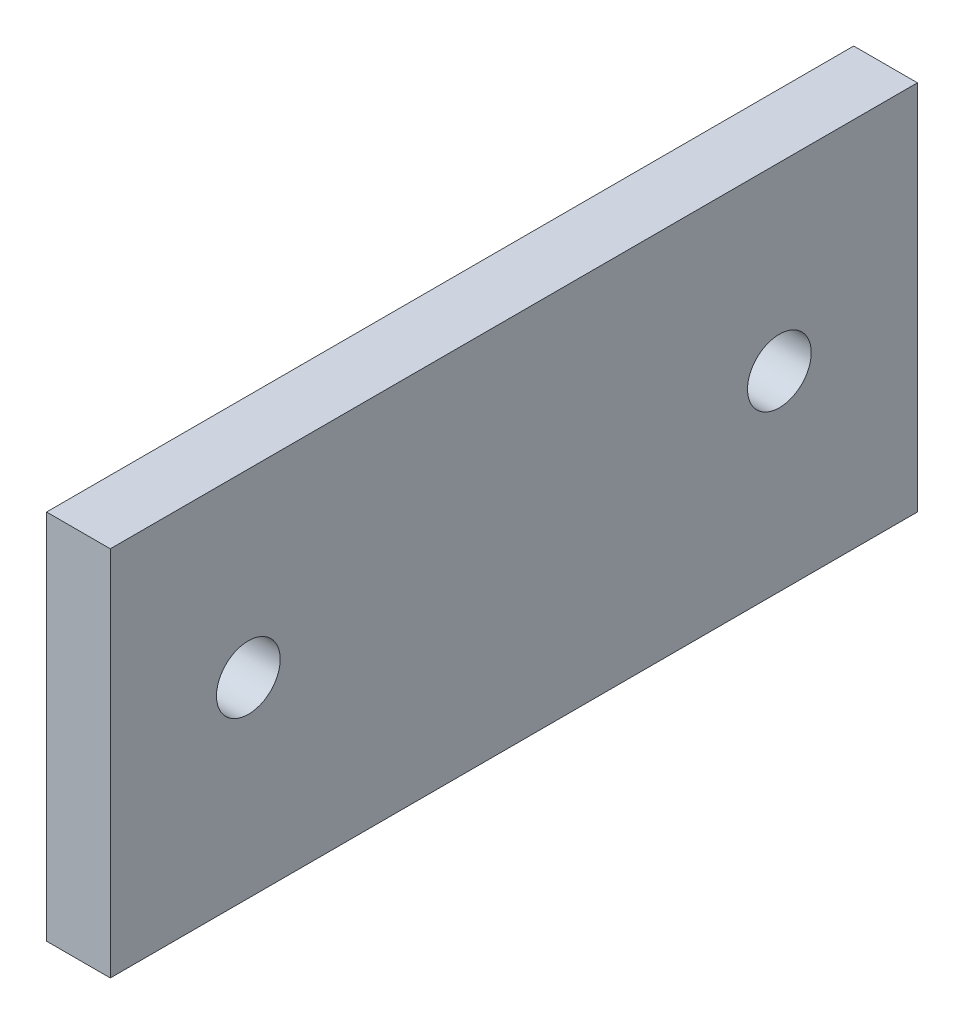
ISO-10303-21;
HEADER;
FILE_DESCRIPTION(('STEP AP214'),'2;1');
FILE_NAME('part.step','',(''),(''),'','','');
FILE_SCHEMA(('AUTOMOTIVE_DESIGN { 1 0 10303 214 1 1 1 1 }'));
ENDSEC;
DATA;
#1=APPLICATION_CONTEXT('core data for automotive mechanical design processes');
#2=APPLICATION_PROTOCOL_DEFINITION('international standard','automotive_design',2000,#1);
#3=PRODUCT_CONTEXT('',#1,'mechanical');
#4=PRODUCT('Part','Part','',(#3));
#5=PRODUCT_RELATED_PRODUCT_CATEGORY('part','',(#4));
#6=PRODUCT_DEFINITION_FORMATION('','',#4);
#7=PRODUCT_DEFINITION_CONTEXT('part definition',#1,'design');
#8=PRODUCT_DEFINITION('design','',#6,#7);
#9=PRODUCT_DEFINITION_SHAPE('','',#8);
#10=(LENGTH_UNIT() NAMED_UNIT(*) SI_UNIT(.MILLI.,.METRE.));
#11=(NAMED_UNIT(*) PLANE_ANGLE_UNIT() SI_UNIT($,.RADIAN.));
#12=(NAMED_UNIT(*) SI_UNIT($,.STERADIAN.) SOLID_ANGLE_UNIT());
#13=UNCERTAINTY_MEASURE_WITH_UNIT(LENGTH_MEASURE(1.E-05),#10,'distance_accuracy_value','');
#14=(GEOMETRIC_REPRESENTATION_CONTEXT(3) GLOBAL_UNCERTAINTY_ASSIGNED_CONTEXT((#13)) GLOBAL_UNIT_ASSIGNED_CONTEXT((#10,
#11,#12)) REPRESENTATION_CONTEXT('',''));
#15=CARTESIAN_POINT('',(0.,0.,0.));
#16=DIRECTION('',(0.,0.,1.));
#17=DIRECTION('',(1.,0.,0.));
#18=AXIS2_PLACEMENT_3D('',#15,#16,#17);
#19=CARTESIAN_POINT('',(3.,0.,0.));
#20=DIRECTION('',(-1.,0.,0.));
#21=DIRECTION('',(0.,0.,1.));
#22=AXIS2_PLACEMENT_3D('',#19,#20,#21);
#23=PLANE('',#22);
#24=DIRECTION('',(0.,1.,0.));
#25=VECTOR('',#24,1.);
#26=CARTESIAN_POINT('',(3.,-17.5,-38.));
#27=LINE('',#26,#25);
#28=CARTESIAN_POINT('',(3.,-17.5,-38.));
#29=VERTEX_POINT('',#28);
#30=CARTESIAN_POINT('',(3.,17.5,-38.));
#31=VERTEX_POINT('',#30);
#32=EDGE_CURVE('E94',#29,#31,#27,.T.);
#33=ORIENTED_EDGE('',*,*,#32,.T.);
#34=DIRECTION('',(0.,0.,1.));
#35=VECTOR('',#34,1.);
#36=CARTESIAN_POINT('',(3.,17.5,38.));
#37=LINE('',#36,#35);
#38=CARTESIAN_POINT('',(3.,17.5,38.));
#39=VERTEX_POINT('',#38);
#40=EDGE_CURVE('E89',#31,#39,#37,.T.);
#41=ORIENTED_EDGE('',*,*,#40,.T.);
#42=DIRECTION('',(0.,-1.,0.));
#43=VECTOR('',#42,1.);
#44=CARTESIAN_POINT('',(3.,-17.5,38.));
#45=LINE('',#44,#43);
#46=CARTESIAN_POINT('',(3.,-17.5,38.));
#47=VERTEX_POINT('',#46);
#48=EDGE_CURVE('E92',#39,#47,#45,.T.);
#49=ORIENTED_EDGE('',*,*,#48,.T.);
#50=DIRECTION('',(0.,0.,-1.));
#51=VECTOR('',#50,1.);
#52=CARTESIAN_POINT('',(3.,-17.5,38.));
#53=LINE('',#52,#51);
#54=EDGE_CURVE('E59',#47,#29,#53,.T.);
#55=ORIENTED_EDGE('',*,*,#54,.T.);
#56=EDGE_LOOP('',(#33,#41,#49,#55));
#57=FACE_BOUND('',#56,.T.);
#58=CARTESIAN_POINT('',(3.,0.5,-25.));
#59=DIRECTION('',(1.,0.,0.));
#60=DIRECTION('',(0.,0.,-1.));
#61=AXIS2_PLACEMENT_3D('',#58,#59,#60);
#62=CIRCLE('',#61,3.);
#63=CARTESIAN_POINT('',(3.,0.5,-28.));
#64=VERTEX_POINT('',#63);
#65=EDGE_CURVE('E115',#64,#64,#62,.T.);
#66=ORIENTED_EDGE('',*,*,#65,.F.);
#67=EDGE_LOOP('',(#66));
#68=FACE_BOUND('',#67,.T.);
#69=CARTESIAN_POINT('',(3.,0.5,25.));
#70=DIRECTION('',(1.,0.,0.));
#71=DIRECTION('',(0.,0.,1.));
#72=AXIS2_PLACEMENT_3D('',#69,#70,#71);
#73=CIRCLE('',#72,3.);
#74=CARTESIAN_POINT('',(3.,0.5,28.));
#75=VERTEX_POINT('',#74);
#76=EDGE_CURVE('E139',#75,#75,#73,.T.);
#77=ORIENTED_EDGE('',*,*,#76,.F.);
#78=EDGE_LOOP('',(#77));
#79=FACE_BOUND('',#78,.T.);
#80=ADVANCED_FACE('F41',(#57,#68,#79),#23,.F.);
#81=CARTESIAN_POINT('',(-3.,0.,0.));
#82=DIRECTION('',(-1.,0.,0.));
#83=DIRECTION('',(0.,0.,1.));
#84=AXIS2_PLACEMENT_3D('',#81,#82,#83);
#85=PLANE('',#84);
#86=CARTESIAN_POINT('',(-3.,0.5,-25.));
#87=DIRECTION('',(1.,0.,0.));
#88=DIRECTION('',(0.,0.,-1.));
#89=AXIS2_PLACEMENT_3D('',#86,#87,#88);
#90=CIRCLE('',#89,3.);
#91=CARTESIAN_POINT('',(-3.,0.5,-28.));
#92=VERTEX_POINT('',#91);
#93=EDGE_CURVE('E135',#92,#92,#90,.T.);
#94=ORIENTED_EDGE('',*,*,#93,.T.);
#95=EDGE_LOOP('',(#94));
#96=FACE_BOUND('',#95,.T.);
#97=DIRECTION('',(0.,1.,0.));
#98=VECTOR('',#97,1.);
#99=CARTESIAN_POINT('',(-3.,-17.5,-38.));
#100=LINE('',#99,#98);
#101=CARTESIAN_POINT('',(-3.,-17.5,-38.));
#102=VERTEX_POINT('',#101);
#103=CARTESIAN_POINT('',(-3.,17.5,-38.));
#104=VERTEX_POINT('',#103);
#105=EDGE_CURVE('E111',#102,#104,#100,.T.);
#106=ORIENTED_EDGE('',*,*,#105,.F.);
#107=DIRECTION('',(0.,0.,-1.));
#108=VECTOR('',#107,1.);
#109=CARTESIAN_POINT('',(-3.,-17.5,38.));
#110=LINE('',#109,#108);
#111=CARTESIAN_POINT('',(-3.,-17.5,38.));
#112=VERTEX_POINT('',#111);
#113=EDGE_CURVE('E82',#112,#102,#110,.T.);
#114=ORIENTED_EDGE('',*,*,#113,.F.);
#115=DIRECTION('',(0.,-1.,0.));
#116=VECTOR('',#115,1.);
#117=CARTESIAN_POINT('',(-3.,-17.5,38.));
#118=LINE('',#117,#116);
#119=CARTESIAN_POINT('',(-3.,17.5,38.));
#120=VERTEX_POINT('',#119);
#121=EDGE_CURVE('E76',#120,#112,#118,.T.);
#122=ORIENTED_EDGE('',*,*,#121,.F.);
#123=DIRECTION('',(0.,0.,1.));
#124=VECTOR('',#123,1.);
#125=CARTESIAN_POINT('',(-3.,17.5,38.));
#126=LINE('',#125,#124);
#127=EDGE_CURVE('E99',#104,#120,#126,.T.);
#128=ORIENTED_EDGE('',*,*,#127,.F.);
#129=EDGE_LOOP('',(#106,#114,#122,#128));
#130=FACE_BOUND('',#129,.T.);
#131=CARTESIAN_POINT('',(-3.,0.5,25.));
#132=DIRECTION('',(1.,0.,0.));
#133=DIRECTION('',(0.,0.,1.));
#134=AXIS2_PLACEMENT_3D('',#131,#132,#133);
#135=CIRCLE('',#134,3.);
#136=CARTESIAN_POINT('',(-3.,0.5,28.));
#137=VERTEX_POINT('',#136);
#138=EDGE_CURVE('E143',#137,#137,#135,.T.);
#139=ORIENTED_EDGE('',*,*,#138,.T.);
#140=EDGE_LOOP('',(#139));
#141=FACE_BOUND('',#140,.T.);
#142=ADVANCED_FACE('F129',(#96,#130,#141),#85,.T.);
#143=CARTESIAN_POINT('',(3.,-17.5,-38.));
#144=DIRECTION('',(0.,0.,1.));
#145=DIRECTION('',(1.,0.,0.));
#146=AXIS2_PLACEMENT_3D('',#143,#144,#145);
#147=PLANE('',#146);
#148=ORIENTED_EDGE('',*,*,#105,.T.);
#149=DIRECTION('',(-1.,0.,0.));
#150=VECTOR('',#149,1.);
#151=CARTESIAN_POINT('',(3.,17.5,-38.));
#152=LINE('',#151,#150);
#153=EDGE_CURVE('E11',#31,#104,#152,.T.);
#154=ORIENTED_EDGE('',*,*,#153,.F.);
#155=ORIENTED_EDGE('',*,*,#32,.F.);
#156=DIRECTION('',(-1.,0.,0.));
#157=VECTOR('',#156,1.);
#158=CARTESIAN_POINT('',(3.,-17.5,-38.));
#159=LINE('',#158,#157);
#160=EDGE_CURVE('E107',#29,#102,#159,.T.);
#161=ORIENTED_EDGE('',*,*,#160,.T.);
#162=EDGE_LOOP('',(#148,#154,#155,#161));
#163=FACE_BOUND('',#162,.T.);
#164=ADVANCED_FACE('F43',(#163),#147,.F.);
#165=CARTESIAN_POINT('',(3.,17.5,38.));
#166=DIRECTION('',(0.,-1.,0.));
#167=DIRECTION('',(0.,0.,-1.));
#168=AXIS2_PLACEMENT_3D('',#165,#166,#167);
#169=PLANE('',#168);
#170=ORIENTED_EDGE('',*,*,#127,.T.);
#171=DIRECTION('',(-1.,0.,0.));
#172=VECTOR('',#171,1.);
#173=CARTESIAN_POINT('',(3.,17.5,38.));
#174=LINE('',#173,#172);
#175=EDGE_CURVE('E51',#39,#120,#174,.T.);
#176=ORIENTED_EDGE('',*,*,#175,.F.);
#177=ORIENTED_EDGE('',*,*,#40,.F.);
#178=ORIENTED_EDGE('',*,*,#153,.T.);
#179=EDGE_LOOP('',(#170,#176,#177,#178));
#180=FACE_BOUND('',#179,.T.);
#181=ADVANCED_FACE('F98',(#180),#169,.F.);
#182=CARTESIAN_POINT('',(3.,-17.5,38.));
#183=DIRECTION('',(0.,0.,-1.));
#184=DIRECTION('',(-1.,0.,0.));
#185=AXIS2_PLACEMENT_3D('',#182,#183,#184);
#186=PLANE('',#185);
#187=ORIENTED_EDGE('',*,*,#121,.T.);
#188=DIRECTION('',(-1.,0.,0.));
#189=VECTOR('',#188,1.);
#190=CARTESIAN_POINT('',(3.,-17.5,38.));
#191=LINE('',#190,#189);
#192=EDGE_CURVE('E101',#47,#112,#191,.T.);
#193=ORIENTED_EDGE('',*,*,#192,.F.);
#194=ORIENTED_EDGE('',*,*,#48,.F.);
#195=ORIENTED_EDGE('',*,*,#175,.T.);
#196=EDGE_LOOP('',(#187,#193,#194,#195));
#197=FACE_BOUND('',#196,.T.);
#198=ADVANCED_FACE('F102',(#197),#186,.F.);
#199=CARTESIAN_POINT('',(3.,-17.5,38.));
#200=DIRECTION('',(0.,1.,0.));
#201=DIRECTION('',(0.,0.,1.));
#202=AXIS2_PLACEMENT_3D('',#199,#200,#201);
#203=PLANE('',#202);
#204=ORIENTED_EDGE('',*,*,#113,.T.);
#205=ORIENTED_EDGE('',*,*,#160,.F.);
#206=ORIENTED_EDGE('',*,*,#54,.F.);
#207=ORIENTED_EDGE('',*,*,#192,.T.);
#208=EDGE_LOOP('',(#204,#205,#206,#207));
#209=FACE_BOUND('',#208,.T.);
#210=ADVANCED_FACE('F126',(#209),#203,.F.);
#211=CARTESIAN_POINT('',(3.,0.5,-25.));
#212=DIRECTION('',(-1.,0.,0.));
#213=DIRECTION('',(0.,0.,1.));
#214=AXIS2_PLACEMENT_3D('',#211,#212,#213);
#215=CYLINDRICAL_SURFACE('',#214,3.);
#216=ORIENTED_EDGE('',*,*,#65,.T.);
#217=EDGE_LOOP('',(#216));
#218=FACE_BOUND('',#217,.T.);
#219=ORIENTED_EDGE('',*,*,#93,.F.);
#220=EDGE_LOOP('',(#219));
#221=FACE_BOUND('',#220,.T.);
#222=ADVANCED_FACE('F163',(#218,#221),#215,.F.);
#223=CARTESIAN_POINT('',(3.,0.5,25.));
#224=DIRECTION('',(-1.,0.,0.));
#225=DIRECTION('',(0.,0.,1.));
#226=AXIS2_PLACEMENT_3D('',#223,#224,#225);
#227=CYLINDRICAL_SURFACE('',#226,3.);
#228=ORIENTED_EDGE('',*,*,#76,.T.);
#229=EDGE_LOOP('',(#228));
#230=FACE_BOUND('',#229,.T.);
#231=ORIENTED_EDGE('',*,*,#138,.F.);
#232=EDGE_LOOP('',(#231));
#233=FACE_BOUND('',#232,.T.);
#234=ADVANCED_FACE('F152',(#230,#233),#227,.F.);
#235=CLOSED_SHELL('',(#80,#142,#164,#181,#198,#210,#222,#234));
#236=MANIFOLD_SOLID_BREP('B2',#235);
#237=ADVANCED_BREP_SHAPE_REPRESENTATION('',(#18,#236),#14);
#238=SHAPE_DEFINITION_REPRESENTATION(#9,#237);
ENDSEC;
END-ISO-10303-21;
